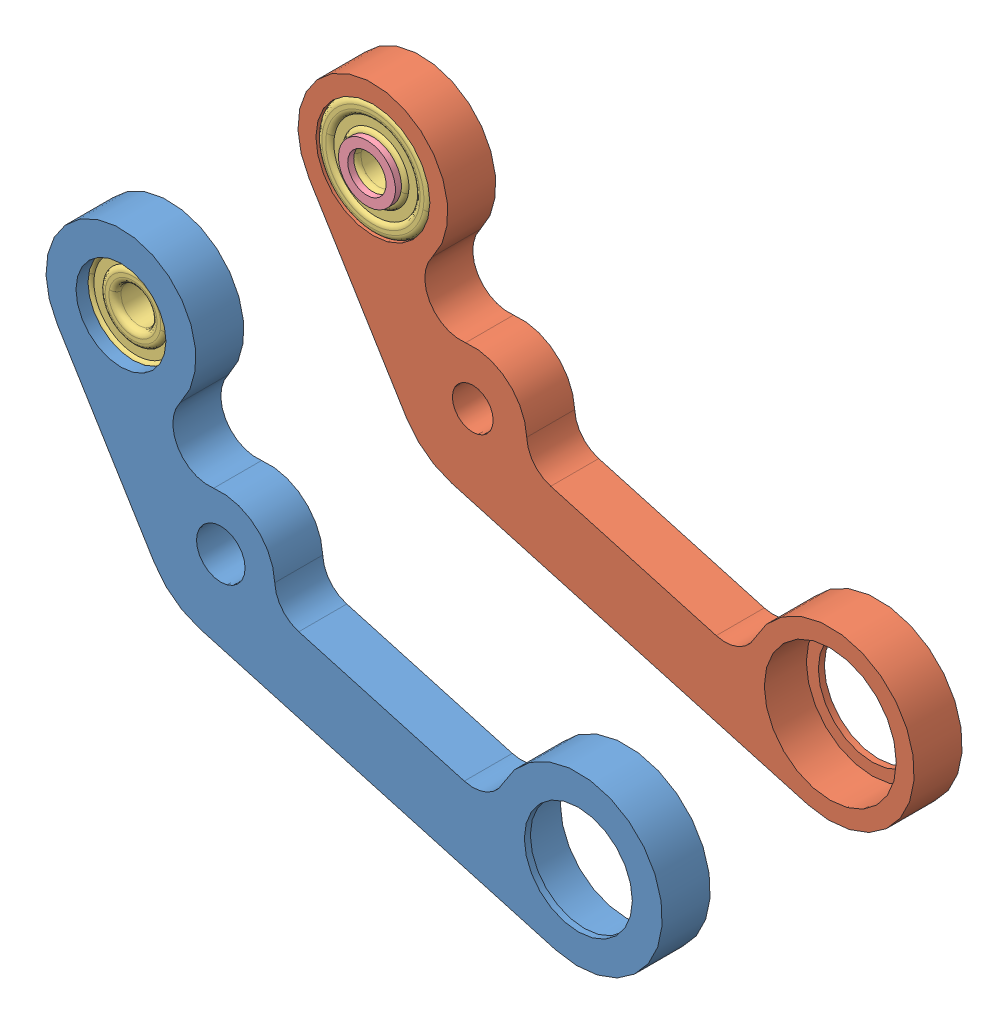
SolidWorks assembly basculeur.SLDASM, configuration Défaut (file format 9000). Lengths in mm.
Overall size (102.74 68.41 55.7).
9 component instances, 6 part files, 17 mates.
Components (placement in the parent):
- levier droit-1: levier droit.SLDPRT [Défaut] at origin size (102.74 68.41 8)
- levier gauche-1: levier gauche.SLDPRT [Défaut] at origin size (102.74 68.41 8)
- roulement 6x19x6-1: roulement 6x19x6.SLDPRT [Défaut] at (67.0763 38.8324 -2) size (20.41 22.31 6)
- roulement 6x19x6-2: roulement 6x19x6.SLDPRT [Défaut] at (67.0763 38.8324 -42) size (20.41 22.31 6)
- vis M6x16 bombee-1: vis M6x16 bombee.SLDPRT [Défaut] at (33.8644 10.2544 0) x (-0.832016 -0.554751 0) z (0 0 -1) size (10 10 19.3)
- rondelle 6x1-1: rondelle 6x1.SLDPRT [Défaut] at (0 0 33) size (9.5 9.5 1)
- vis M6x16 bombee-2: vis M6x16 bombee.SLDPRT [Défaut] at (-85.8544 -5.3638 0) x (0.946491 -0.322731 0) z (0 0 1) size (10 10 19.3)
- rondelle 6x1-2: rondelle 6x1.SLDPRT [Défaut] at origin size (9.5 9.5 1)
- vis M8x50 bombee-1: vis M8x50 bombee.SLDPRT [Défaut] at (139.2326 367.1049 -10) x (0.367432 -0.930051 0) z (0 0 -1) size (15 15 54.4)
Mates (geometry in assembly coordinates):
- Coaxial1: concentric anti-aligned: cylinder of levier droit-1 through (-59.1026 256.2254 23) axis (0 0 -1) radius 9.5; cylinder of roulement 6x19x6-1 through (-59.1026 256.2254 18) axis (0 0 1) radius 9.5
- Coïncidente1: coincident anti-aligned: plane of levier droit-1 through (-46.0466 260.0199 23) normal (0 0 -1); plane of roulement 6x19x6-1 through (-64.5686 252.4694 23) normal (0 0 1)
- Coaxial2: concentric aligned: cylinder of levier gauche-1 through (-59.1026 256.2254 -23) axis (0 0 1) radius 9.5; cylinder of roulement 6x19x6-2 through (-59.1026 256.2254 -22) axis (0 0 1) radius 9.5
- Coïncidente2: coincident anti-aligned: plane of levier gauche-1 through (-46.0466 260.0199 -23) normal (0 0 1); plane of roulement 6x19x6-2 through (-55.3466 250.7595 -23) normal (0 0 -1)
- Coaxial3: concentric aligned: cylinder of roulement 6x19x6-1 through (-59.1026 256.2254 18) axis (0 0 1) radius 3; cylinder of vis M6x16 bombee-1 through (-59.1026 256.2254 8) axis (0 0 1) radius 3
- Coïncidente3: coincident anti-aligned: plane of roulement 6x19x6-1 through (-64.5686 252.4694 23) normal (0 0 1); plane of vis M6x16 bombee-1 through (-56.7407 262.9803 23) normal (0 0 -1)
- Coaxial4: concentric anti-aligned: cylinder of vis M6x16 bombee-1 through (-59.1026 256.2254 8) axis (0 0 1) radius 3; cylinder of rondelle 6x1-1 through (-59.1026 256.2254 17) axis (0 0 -1) radius 3.2
- Coïncidente4: coincident anti-aligned: plane of roulement 6x19x6-1 through (-55.3466 250.7595 17) normal (0 0 -1); plane of rondelle 6x1-1 through (-65.4157 253.7037 17) normal (0 0 1)
- Coaxial5: concentric aligned: cylinder of roulement 6x19x6-2 through (-59.1026 256.2254 -22) axis (0 0 1) radius 3; cylinder of vis M6x16 bombee-1 through (-59.1026 256.2254 8) axis (0 0 1) radius 3
- Coaxial6: concentric anti-aligned: cylinder of roulement 6x19x6-2 through (-59.1026 256.2254 -22) axis (0 0 1) radius 3; cylinder of vis M6x16 bombee-2 through (-59.1026 256.2254 -8) axis (0 0 -1) radius 3
- Coïncidente5: coincident anti-aligned: plane of roulement 6x19x6-2 through (-55.3466 250.7595 -23) normal (0 0 -1); plane of vis M6x16 bombee-2 through (-63.1184 262.1483 -23) normal (0 0 1)
- Coaxial7: concentric aligned: cylinder of vis M6x16 bombee-2 through (-59.1026 256.2254 -8) axis (0 0 -1) radius 3; cylinder of rondelle 6x1-2 through (-59.1026 256.2254 -16) axis (0 0 -1) radius 3.2
- Coïncidente6: coincident anti-aligned: plane of roulement 6x19x6-2 through (-64.5686 252.4694 -17) normal (0 0 1); plane of rondelle 6x1-2 through (-65.4157 253.7037 -17) normal (0 0 -1)
- Distance1: distance = 32 mm anti-aligned: plane of rondelle 6x1-1 through (-65.4157 253.7037 16) normal (0 0 -1); plane of rondelle 6x1-2 through (-65.4157 253.7037 -16) normal (0 0 1)
- Coïncidente7: coincident anti-aligned: plane of levier droit-1 through (16.4399 182.567 25) normal (0 0 1); plane of vis M8x50 bombee-1 through (-32.6388 225.7232 25) normal (0 0 -1)
- Coaxial8: concentric aligned: cylinder of levier gauche-1 through (-42.4575 230.0601 -17) axis (0 0 1) radius 3.4; cylinder of vis M8x50 bombee-1 through (-42.4575 230.0601 10.25) axis (0 0 1) radius 4
- Coaxial10: concentric anti-aligned: cylinder of levier droit-1 through (-42.4575 230.0601 25) axis (0 0 -1) radius 4.05; cylinder of vis M8x50 bombee-1 through (-42.4575 230.0601 10.25) axis (0 0 1) radius 4
